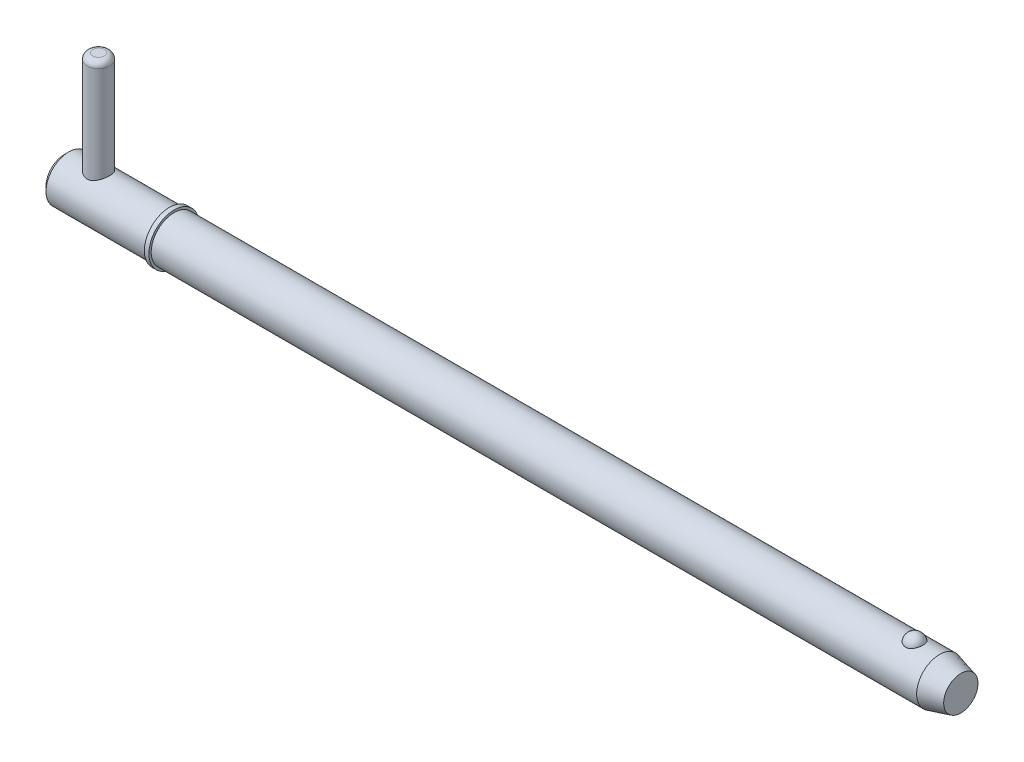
ISO-10303-21;
HEADER;
FILE_DESCRIPTION(('STEP AP214'),'2;1');
FILE_NAME('part.step','',(''),(''),'','','');
FILE_SCHEMA(('AUTOMOTIVE_DESIGN { 1 0 10303 214 1 1 1 1 }'));
ENDSEC;
DATA;
#1=APPLICATION_CONTEXT('core data for automotive mechanical design processes');
#2=APPLICATION_PROTOCOL_DEFINITION('international standard','automotive_design',2000,#1);
#3=PRODUCT_CONTEXT('',#1,'mechanical');
#4=PRODUCT('Part','Part','',(#3));
#5=PRODUCT_RELATED_PRODUCT_CATEGORY('part','',(#4));
#6=PRODUCT_DEFINITION_FORMATION('','',#4);
#7=PRODUCT_DEFINITION_CONTEXT('part definition',#1,'design');
#8=PRODUCT_DEFINITION('design','',#6,#7);
#9=PRODUCT_DEFINITION_SHAPE('','',#8);
#10=(LENGTH_UNIT() NAMED_UNIT(*) SI_UNIT(.MILLI.,.METRE.));
#11=(NAMED_UNIT(*) PLANE_ANGLE_UNIT() SI_UNIT($,.RADIAN.));
#12=(NAMED_UNIT(*) SI_UNIT($,.STERADIAN.) SOLID_ANGLE_UNIT());
#13=UNCERTAINTY_MEASURE_WITH_UNIT(LENGTH_MEASURE(1.E-05),#10,'distance_accuracy_value','');
#14=(GEOMETRIC_REPRESENTATION_CONTEXT(3) GLOBAL_UNCERTAINTY_ASSIGNED_CONTEXT((#13)) GLOBAL_UNIT_ASSIGNED_CONTEXT((#10,
#11,#12)) REPRESENTATION_CONTEXT('',''));
#15=CARTESIAN_POINT('',(0.,0.,0.));
#16=DIRECTION('',(0.,0.,1.));
#17=DIRECTION('',(1.,0.,0.));
#18=AXIS2_PLACEMENT_3D('',#15,#16,#17);
#19=CARTESIAN_POINT('',(5.94,21.43,0.));
#20=DIRECTION('',(0.,-1.,0.));
#21=DIRECTION('',(0.,0.,-1.));
#22=AXIS2_PLACEMENT_3D('',#19,#20,#21);
#23=CYLINDRICAL_SURFACE('',#22,1.98);
#24=CARTESIAN_POINT('',(5.94,-2.98,0.));
#25=DIRECTION('',(0.,1.,0.));
#26=DIRECTION('',(0.,0.,1.));
#27=AXIS2_PLACEMENT_3D('',#24,#25,#26);
#28=CIRCLE('',#27,1.98);
#29=CARTESIAN_POINT('',(5.94,-2.98,1.98));
#30=VERTEX_POINT('',#29);
#31=EDGE_CURVE('P0_E25',#30,#30,#28,.T.);
#32=ORIENTED_EDGE('',*,*,#31,.T.);
#33=EDGE_LOOP('',(#32));
#34=FACE_BOUND('',#33,.T.);
#35=CARTESIAN_POINT('',(5.94,20.44,0.));
#36=DIRECTION('',(0.,1.,0.));
#37=DIRECTION('',(0.,0.,1.));
#38=AXIS2_PLACEMENT_3D('',#35,#36,#37);
#39=CIRCLE('',#38,1.98);
#40=CARTESIAN_POINT('',(5.94,20.44,1.98));
#41=VERTEX_POINT('',#40);
#42=EDGE_CURVE('P0_E29',#41,#41,#39,.F.);
#43=ORIENTED_EDGE('',*,*,#42,.T.);
#44=EDGE_LOOP('',(#43));
#45=FACE_BOUND('',#44,.T.);
#46=ADVANCED_FACE('P0_F14',(#34,#45),#23,.T.);
#47=CARTESIAN_POINT('',(5.94,21.43,0.));
#48=DIRECTION('',(0.,1.,0.));
#49=DIRECTION('',(0.,0.,1.));
#50=AXIS2_PLACEMENT_3D('',#47,#48,#49);
#51=PLANE('',#50);
#52=CARTESIAN_POINT('',(5.94,21.43,0.));
#53=DIRECTION('',(0.,1.,0.));
#54=DIRECTION('',(0.,0.,1.));
#55=AXIS2_PLACEMENT_3D('',#52,#53,#54);
#56=CIRCLE('',#55,0.99);
#57=CARTESIAN_POINT('',(5.94,21.43,0.99));
#58=VERTEX_POINT('',#57);
#59=EDGE_CURVE('P0_E10',#58,#58,#56,.T.);
#60=ORIENTED_EDGE('',*,*,#59,.T.);
#61=EDGE_LOOP('',(#60));
#62=FACE_BOUND('',#61,.T.);
#63=ADVANCED_FACE('P0_F46',(#62),#51,.T.);
#64=CARTESIAN_POINT('',(5.94,-3.97,0.));
#65=DIRECTION('',(0.,1.,0.));
#66=DIRECTION('',(0.,0.,1.));
#67=AXIS2_PLACEMENT_3D('',#64,#65,#66);
#68=PLANE('',#67);
#69=CARTESIAN_POINT('',(5.94,-3.97,0.));
#70=DIRECTION('',(0.,1.,0.));
#71=DIRECTION('',(0.,0.,1.));
#72=AXIS2_PLACEMENT_3D('',#69,#70,#71);
#73=CIRCLE('',#72,0.99);
#74=CARTESIAN_POINT('',(5.94,-3.97,0.99));
#75=VERTEX_POINT('',#74);
#76=EDGE_CURVE('P0_E21',#75,#75,#73,.F.);
#77=ORIENTED_EDGE('',*,*,#76,.T.);
#78=EDGE_LOOP('',(#77));
#79=FACE_BOUND('',#78,.T.);
#80=ADVANCED_FACE('P0_F43',(#79),#68,.F.);
#81=CARTESIAN_POINT('',(5.94,-2.98,0.));
#82=DIRECTION('',(0.,1.,0.));
#83=DIRECTION('',(0.,0.,1.));
#84=AXIS2_PLACEMENT_3D('',#81,#82,#83);
#85=DEGENERATE_TOROIDAL_SURFACE('',#84,0.99,0.99,.T.);
#86=ORIENTED_EDGE('',*,*,#76,.F.);
#87=EDGE_LOOP('',(#86));
#88=FACE_BOUND('',#87,.T.);
#89=ORIENTED_EDGE('',*,*,#31,.F.);
#90=EDGE_LOOP('',(#89));
#91=FACE_BOUND('',#90,.T.);
#92=ADVANCED_FACE('P0_F38',(#88,#91),#85,.T.);
#93=CARTESIAN_POINT('',(5.94,20.44,0.));
#94=DIRECTION('',(0.,1.,0.));
#95=DIRECTION('',(0.,0.,1.));
#96=AXIS2_PLACEMENT_3D('',#93,#94,#95);
#97=DEGENERATE_TOROIDAL_SURFACE('',#96,0.99,0.99,.T.);
#98=ORIENTED_EDGE('',*,*,#42,.F.);
#99=EDGE_LOOP('',(#98));
#100=FACE_BOUND('',#99,.T.);
#101=ORIENTED_EDGE('',*,*,#59,.F.);
#102=EDGE_LOOP('',(#101));
#103=FACE_BOUND('',#102,.T.);
#104=ADVANCED_FACE('P0_F16',(#100,#103),#97,.T.);
#105=CLOSED_SHELL('',(#46,#63,#80,#92,#104));
#106=MANIFOLD_SOLID_BREP('P0_B1',#105);
#107=CARTESIAN_POINT('',(0.,0.,0.));
#108=DIRECTION('',(1.,0.,0.));
#109=DIRECTION('',(0.,0.,-1.));
#110=AXIS2_PLACEMENT_3D('',#107,#108,#109);
#111=CYLINDRICAL_SURFACE('',#110,3.97);
#112=CARTESIAN_POINT('',(151.875939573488,0.,0.));
#113=DIRECTION('',(1.,0.,0.));
#114=DIRECTION('',(0.,0.,-1.));
#115=AXIS2_PLACEMENT_3D('',#112,#113,#114);
#116=CIRCLE('',#115,3.97);
#117=CARTESIAN_POINT('',(151.875939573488,0.,-3.97));
#118=VERTEX_POINT('',#117);
#119=EDGE_CURVE('P1_E81',#118,#118,#116,.T.);
#120=ORIENTED_EDGE('',*,*,#119,.F.);
#121=EDGE_LOOP('',(#120));
#122=FACE_BOUND('',#121,.T.);
#123=CARTESIAN_POINT('',(19.05,0.,0.));
#124=DIRECTION('',(1.,0.,0.));
#125=DIRECTION('',(0.,0.,-1.));
#126=AXIS2_PLACEMENT_3D('',#123,#124,#125);
#127=CIRCLE('',#126,3.97);
#128=CARTESIAN_POINT('',(19.05,0.,-3.97));
#129=VERTEX_POINT('',#128);
#130=EDGE_CURVE('P1_E85',#129,#129,#127,.T.);
#131=ORIENTED_EDGE('',*,*,#130,.T.);
#132=EDGE_LOOP('',(#131));
#133=FACE_BOUND('',#132,.T.);
#134=CARTESIAN_POINT('',(147.545192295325,3.65715365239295,1.54470941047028));
#135=CARTESIAN_POINT('',(147.465244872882,3.65716001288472,1.54470290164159));
#136=CARTESIAN_POINT('',(147.385165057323,3.65987074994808,1.53832549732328));
#137=CARTESIAN_POINT('',(147.227237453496,3.67042218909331,1.51297018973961));
#138=CARTESIAN_POINT('',(147.14939614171,3.67827646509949,1.49395894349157));
#139=CARTESIAN_POINT('',(146.998461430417,3.69818848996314,1.44395950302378));
#140=CARTESIAN_POINT('',(146.925356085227,3.71023513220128,1.41300293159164));
#141=CARTESIAN_POINT('',(146.785563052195,3.73721833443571,1.34000212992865));
#142=CARTESIAN_POINT('',(146.718872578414,3.75215363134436,1.2979627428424));
#143=CARTESIAN_POINT('',(146.59148864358,3.78384968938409,1.20248834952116));
#144=CARTESIAN_POINT('',(146.531029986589,3.80065129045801,1.14875388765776));
#145=CARTESIAN_POINT('',(146.419694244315,3.83398532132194,1.03205417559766));
#146=CARTESIAN_POINT('',(146.368820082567,3.85051766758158,0.96908611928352));
#147=CARTESIAN_POINT('',(146.275632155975,3.88238608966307,0.832526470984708));
#148=CARTESIAN_POINT('',(146.233796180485,3.89763698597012,0.758588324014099));
#149=CARTESIAN_POINT('',(146.162510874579,3.92451063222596,0.604352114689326));
#150=CARTESIAN_POINT('',(146.133062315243,3.93613315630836,0.52405365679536));
#151=CARTESIAN_POINT('',(146.086892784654,3.95467606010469,0.358403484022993));
#152=CARTESIAN_POINT('',(146.070312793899,3.96154426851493,0.273006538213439));
#153=CARTESIAN_POINT('',(146.050756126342,3.96967008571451,0.100408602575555));
#154=CARTESIAN_POINT('',(146.047778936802,3.97092790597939,0.0132076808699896));
#155=CARTESIAN_POINT('',(146.055458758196,3.96771794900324,-0.159844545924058));
#156=CARTESIAN_POINT('',(146.066016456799,3.96329187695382,-0.245701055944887));
#157=CARTESIAN_POINT('',(146.10038009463,3.94923163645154,-0.414277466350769));
#158=CARTESIAN_POINT('',(146.124186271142,3.93959737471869,-0.496997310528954));
#159=CARTESIAN_POINT('',(146.18461142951,3.91607752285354,-0.65711357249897));
#160=CARTESIAN_POINT('',(146.221249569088,3.90218558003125,-0.734501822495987));
#161=CARTESIAN_POINT('',(146.306593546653,3.87158287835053,-0.881704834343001));
#162=CARTESIAN_POINT('',(146.355300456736,3.85487186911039,-0.951518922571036));
#163=CARTESIAN_POINT('',(146.464116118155,3.82028735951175,-1.08208159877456));
#164=CARTESIAN_POINT('',(146.524295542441,3.80240713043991,-1.14276958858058));
#165=CARTESIAN_POINT('',(146.654493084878,3.76758161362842,-1.25282437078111));
#166=CARTESIAN_POINT('',(146.724510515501,3.75063626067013,-1.30219195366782));
#167=CARTESIAN_POINT('',(146.87118160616,3.71998948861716,-1.38729709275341));
#168=CARTESIAN_POINT('',(146.947681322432,3.70623183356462,-1.42327904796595));
#169=CARTESIAN_POINT('',(147.106298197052,3.68323188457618,-1.48178996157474));
#170=CARTESIAN_POINT('',(147.1884132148,3.67398788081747,-1.50432401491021));
#171=CARTESIAN_POINT('',(147.351481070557,3.6615216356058,-1.53440939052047));
#172=CARTESIAN_POINT('',(147.432284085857,3.65801951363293,-1.54265826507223));
#173=CARTESIAN_POINT('',(147.59420850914,3.65657341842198,-1.54608423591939));
#174=CARTESIAN_POINT('',(147.675329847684,3.65862829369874,-1.54126404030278));
#175=CARTESIAN_POINT('',(147.832812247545,3.66788969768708,-1.51908474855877));
#176=CARTESIAN_POINT('',(147.909242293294,3.67492621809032,-1.50213925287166));
#177=CARTESIAN_POINT('',(148.058041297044,3.6931840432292,-1.45666982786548));
#178=CARTESIAN_POINT('',(148.130409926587,3.70440568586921,-1.42814496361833));
#179=CARTESIAN_POINT('',(148.270802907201,3.73012749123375,-1.3595631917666));
#180=CARTESIAN_POINT('',(148.338700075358,3.74469307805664,-1.31927107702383));
#181=CARTESIAN_POINT('',(148.466864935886,3.77545272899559,-1.22847440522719));
#182=CARTESIAN_POINT('',(148.527130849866,3.79164717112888,-1.17796747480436));
#183=CARTESIAN_POINT('',(148.641634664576,3.82490325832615,-1.06519260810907));
#184=CARTESIAN_POINT('',(148.695413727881,3.84196735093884,-1.00245914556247));
#185=CARTESIAN_POINT('',(148.792098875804,3.87439863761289,-0.868715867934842));
#186=CARTESIAN_POINT('',(148.835003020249,3.88976552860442,-0.797704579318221));
#187=CARTESIAN_POINT('',(148.910266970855,3.91771381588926,-0.646896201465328));
#188=CARTESIAN_POINT('',(148.94225322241,3.93019255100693,-0.566893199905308));
#189=CARTESIAN_POINT('',(148.993110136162,3.95043886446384,-0.402255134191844));
#190=CARTESIAN_POINT('',(149.011980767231,3.95820643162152,-0.317620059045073));
#191=CARTESIAN_POINT('',(149.03621625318,3.96823733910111,-0.14615699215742));
#192=CARTESIAN_POINT('',(149.041587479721,3.970503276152,-0.0593300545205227));
#193=CARTESIAN_POINT('',(149.038730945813,3.96930811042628,0.11405797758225));
#194=CARTESIAN_POINT('',(149.030503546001,3.9658471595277,0.200619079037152));
#195=CARTESIAN_POINT('',(149.000706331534,3.95358562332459,0.37050665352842));
#196=CARTESIAN_POINT('',(148.97921294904,3.94481563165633,0.453848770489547));
#197=CARTESIAN_POINT('',(148.92338397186,3.92284586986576,0.615497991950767));
#198=CARTESIAN_POINT('',(148.889047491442,3.90964579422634,0.693804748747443));
#199=CARTESIAN_POINT('',(148.807970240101,3.88006987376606,0.843703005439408));
#200=CARTESIAN_POINT('',(148.761153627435,3.86367478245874,0.915249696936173));
#201=CARTESIAN_POINT('',(148.656189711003,3.82949741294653,1.04910810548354));
#202=CARTESIAN_POINT('',(148.598042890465,3.81171519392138,1.11142021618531));
#203=CARTESIAN_POINT('',(148.471743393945,3.7767336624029,1.22503948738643));
#204=CARTESIAN_POINT('',(148.403597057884,3.75953398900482,1.27635357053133));
#205=CARTESIAN_POINT('',(148.258900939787,3.72770506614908,1.36653336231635));
#206=CARTESIAN_POINT('',(148.182348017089,3.7130767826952,1.4053943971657));
#207=CARTESIAN_POINT('',(148.025759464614,3.68864287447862,1.46830480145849));
#208=CARTESIAN_POINT('',(147.945930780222,3.67869017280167,1.49281289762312));
#209=CARTESIAN_POINT('',(147.782987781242,3.66414535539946,1.52817474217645));
#210=CARTESIAN_POINT('',(147.699884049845,3.65953723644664,1.53906926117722));
#211=CARTESIAN_POINT('',(147.592776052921,3.6573894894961,1.54414878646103));
#212=CARTESIAN_POINT('',(147.568990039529,3.65715175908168,1.54471134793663));
#213=CARTESIAN_POINT('',(147.545192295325,3.65715365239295,1.54470941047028));
#214=B_SPLINE_CURVE_WITH_KNOTS('',3,(#134,#135,#136,#137,#138,#139,#140,#141,#142,#143,#144,
#145,#146,#147,#148,#149,#150,#151,#152,#153,#154,#155,#156,#157,#158,#159,#160,#161,#162,#163,
#164,#165,#166,#167,#168,#169,#170,#171,#172,#173,#174,#175,#176,#177,#178,#179,#180,#181,#182,
#183,#184,#185,#186,#187,#188,#189,#190,#191,#192,#193,#194,#195,#196,#197,#198,#199,#200,#201,
#202,#203,#204,#205,#206,#207,#208,#209,#210,#211,#212,#213),.UNSPECIFIED.,.T.,.F.,(4,2,2,2,2,2,
2,2,2,2,2,2,2,2,2,2,2,2,2,2,2,2,2,2,2,2,2,2,2,2,2,2,2,2,2,2,2,2,2,4),(0.,0.239777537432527,
0.48019041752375,0.719971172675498,0.959647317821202,1.20639040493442,1.45320863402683,
1.71093679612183,1.96868099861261,2.22921052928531,2.48973023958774,2.74834928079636,
3.00697295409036,3.26598440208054,3.52501886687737,3.78570385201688,4.04637062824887,
4.30201257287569,4.55755760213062,4.80022994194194,5.04285200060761,5.27757006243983,
5.5123070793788,5.75210128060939,5.99195126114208,6.24392810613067,6.49594987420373,
6.75588818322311,7.01582710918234,7.2756433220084,7.53545264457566,7.79377886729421,
8.05212290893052,8.31207418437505,8.57201437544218,8.83179046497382,9.09166393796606,
9.34270057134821,9.59298357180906,9.66435753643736),.UNSPECIFIED.);
#215=CARTESIAN_POINT('',(147.545192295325,3.65715365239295,1.54470941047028));
#216=VERTEX_POINT('',#215);
#217=EDGE_CURVE('P1_E35',#216,#216,#214,.T.);
#218=ORIENTED_EDGE('',*,*,#217,.T.);
#219=EDGE_LOOP('',(#218));
#220=FACE_BOUND('',#219,.T.);
#221=ADVANCED_FACE('P1_F13',(#122,#133,#220),#111,.T.);
#222=CARTESIAN_POINT('',(0.,0.,0.));
#223=DIRECTION('',(-1.,0.,0.));
#224=DIRECTION('',(0.,0.,1.));
#225=AXIS2_PLACEMENT_3D('',#222,#223,#224);
#226=PLANE('',#225);
#227=CARTESIAN_POINT('',(0.,0.,0.));
#228=DIRECTION('',(1.,0.,0.));
#229=DIRECTION('',(0.,0.,-1.));
#230=AXIS2_PLACEMENT_3D('',#227,#228,#229);
#231=CIRCLE('',#230,3.176);
#232=CARTESIAN_POINT('',(0.,0.,-3.176));
#233=VERTEX_POINT('',#232);
#234=EDGE_CURVE('P1_E9',#233,#233,#231,.T.);
#235=ORIENTED_EDGE('',*,*,#234,.F.);
#236=EDGE_LOOP('',(#235));
#237=FACE_BOUND('',#236,.T.);
#238=ADVANCED_FACE('P1_F15',(#237),#226,.T.);
#239=CARTESIAN_POINT('',(0.793999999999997,0.,0.));
#240=DIRECTION('',(1.,0.,0.));
#241=DIRECTION('',(0.,0.,-1.));
#242=AXIS2_PLACEMENT_3D('',#239,#240,#241);
#243=CONICAL_SURFACE('',#242,3.97,0.78539816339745);
#244=ORIENTED_EDGE('',*,*,#234,.T.);
#245=EDGE_LOOP('',(#244));
#246=FACE_BOUND('',#245,.T.);
#247=CARTESIAN_POINT('',(0.793999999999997,0.,0.));
#248=DIRECTION('',(1.,0.,0.));
#249=DIRECTION('',(0.,0.,-1.));
#250=AXIS2_PLACEMENT_3D('',#247,#248,#249);
#251=CIRCLE('',#250,3.97);
#252=CARTESIAN_POINT('',(0.793999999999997,0.,-3.97));
#253=VERTEX_POINT('',#252);
#254=EDGE_CURVE('P1_E26',#253,#253,#251,.T.);
#255=ORIENTED_EDGE('',*,*,#254,.F.);
#256=EDGE_LOOP('',(#255));
#257=FACE_BOUND('',#256,.T.);
#258=ADVANCED_FACE('P1_F77',(#246,#257),#243,.T.);
#259=CARTESIAN_POINT('',(0.,0.,0.));
#260=DIRECTION('',(1.,0.,0.));
#261=DIRECTION('',(0.,0.,-1.));
#262=AXIS2_PLACEMENT_3D('',#259,#260,#261);
#263=CYLINDRICAL_SURFACE('',#262,3.97);
#264=CARTESIAN_POINT('',(5.94,-3.44100276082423,1.98));
#265=CARTESIAN_POINT('',(5.8367885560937,-3.44101282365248,1.97999171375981));
#266=CARTESIAN_POINT('',(5.73344176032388,-3.44571749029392,1.97187534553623));
#267=CARTESIAN_POINT('',(5.52991905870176,-3.46385873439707,1.93981946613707));
#268=CARTESIAN_POINT('',(5.42975031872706,-3.47731375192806,1.91584653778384));
#269=CARTESIAN_POINT('',(5.23590869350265,-3.51100678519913,1.85336773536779));
#270=CARTESIAN_POINT('',(5.14220446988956,-3.53120882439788,1.81493880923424));
#271=CARTESIAN_POINT('',(4.9625969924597,-3.57606420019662,1.72487335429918));
#272=CARTESIAN_POINT('',(4.87669412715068,-3.6007177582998,1.67323616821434));
#273=CARTESIAN_POINT('',(4.70734412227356,-3.65417020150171,1.55325205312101));
#274=CARTESIAN_POINT('',(4.62467662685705,-3.68314323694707,1.4838818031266));
#275=CARTESIAN_POINT('',(4.47154355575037,-3.74056406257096,1.33252902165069));
#276=CARTESIAN_POINT('',(4.40108404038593,-3.76901158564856,1.25054026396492));
#277=CARTESIAN_POINT('',(4.26974803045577,-3.82445556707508,1.06956584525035));
#278=CARTESIAN_POINT('',(4.20982960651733,-3.8512271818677,0.969809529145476));
#279=CARTESIAN_POINT('',(4.10798077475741,-3.89804342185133,0.760047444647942));
#280=CARTESIAN_POINT('',(4.06603907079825,-3.91809226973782,0.650048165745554));
#281=CARTESIAN_POINT('',(4.00441878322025,-3.94794912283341,0.431181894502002));
#282=CARTESIAN_POINT('',(3.98337329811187,-3.95838209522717,0.322786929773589));
#283=CARTESIAN_POINT('',(3.9596425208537,-3.97016407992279,0.103541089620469));
#284=CARTESIAN_POINT('',(3.95694618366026,-3.97151855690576,-0.00730826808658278));
#285=CARTESIAN_POINT('',(3.9694599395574,-3.96528826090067,-0.218044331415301));
#286=CARTESIAN_POINT('',(3.98314071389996,-3.95846689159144,-0.318049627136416));
#287=CARTESIAN_POINT('',(4.02528522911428,-3.93780347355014,-0.514124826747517));
#288=CARTESIAN_POINT('',(4.05375007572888,-3.92396089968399,-0.61019443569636));
#289=CARTESIAN_POINT('',(4.12484256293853,-3.89028355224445,-0.797351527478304));
#290=CARTESIAN_POINT('',(4.16766142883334,-3.87036821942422,-0.888351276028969));
#291=CARTESIAN_POINT('',(4.26598377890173,-3.82634285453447,-1.06209448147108));
#292=CARTESIAN_POINT('',(4.32149181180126,-3.8022313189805,-1.14483496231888));
#293=CARTESIAN_POINT('',(4.44962332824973,-3.74940011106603,-1.30802500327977));
#294=CARTESIAN_POINT('',(4.52336636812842,-3.72046031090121,-1.38752498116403));
#295=CARTESIAN_POINT('',(4.68287656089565,-3.66269463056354,-1.53354043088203));
#296=CARTESIAN_POINT('',(4.7686527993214,-3.63386885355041,-1.60004599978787));
#297=CARTESIAN_POINT('',(4.9564069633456,-3.57763161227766,-1.72228426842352));
#298=CARTESIAN_POINT('',(5.05906485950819,-3.5504233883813,-1.77707534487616));
#299=CARTESIAN_POINT('',(5.27381412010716,-3.50334038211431,-1.86819784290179));
#300=CARTESIAN_POINT('',(5.38589553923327,-3.48345798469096,-1.90454844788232));
#301=CARTESIAN_POINT('',(5.6069795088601,-3.45548331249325,-1.95481643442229));
#302=CARTESIAN_POINT('',(5.71552407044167,-3.44658268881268,-1.97028113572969));
#303=CARTESIAN_POINT('',(5.93399639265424,-3.43928114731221,-1.98300600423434));
#304=CARTESIAN_POINT('',(6.04392313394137,-3.44087289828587,-1.98027888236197));
#305=CARTESIAN_POINT('',(6.24931618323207,-3.45351901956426,-1.95811780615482));
#306=CARTESIAN_POINT('',(6.34505668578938,-3.46352725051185,-1.94052989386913));
#307=CARTESIAN_POINT('',(6.53204702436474,-3.49033612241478,-1.89188242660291));
#308=CARTESIAN_POINT('',(6.62329540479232,-3.50713894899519,-1.86081853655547));
#309=CARTESIAN_POINT('',(6.80352105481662,-3.54655680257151,-1.78458666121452));
#310=CARTESIAN_POINT('',(6.89219712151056,-3.56940508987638,-1.73883178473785));
#311=CARTESIAN_POINT('',(7.06112449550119,-3.61813012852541,-1.63502913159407));
#312=CARTESIAN_POINT('',(7.14137144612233,-3.6440084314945,-1.57697504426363));
#313=CARTESIAN_POINT('',(7.30168083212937,-3.69977514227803,-1.44171920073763));
#314=CARTESIAN_POINT('',(7.38046039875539,-3.7297597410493,-1.36302972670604));
#315=CARTESIAN_POINT('',(7.52409649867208,-3.78754991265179,-1.19307190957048));
#316=CARTESIAN_POINT('',(7.58894840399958,-3.81535475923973,-1.10179940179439));
#317=CARTESIAN_POINT('',(7.70430122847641,-3.86658972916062,-0.906019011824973));
#318=CARTESIAN_POINT('',(7.75438714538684,-3.88988795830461,-0.801229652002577));
#319=CARTESIAN_POINT('',(7.83572184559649,-3.92848199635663,-0.583216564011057));
#320=CARTESIAN_POINT('',(7.86698708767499,-3.94378479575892,-0.470000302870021));
#321=CARTESIAN_POINT('',(7.90711051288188,-3.96355307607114,-0.249525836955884));
#322=CARTESIAN_POINT('',(7.91775648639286,-3.96888171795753,-0.142669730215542));
#323=CARTESIAN_POINT('',(7.92160247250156,-3.97079858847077,0.0714191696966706));
#324=CARTESIAN_POINT('',(7.91480852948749,-3.96738984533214,0.178651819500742));
#325=CARTESIAN_POINT('',(7.88515479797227,-3.9527181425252,0.383072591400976));
#326=CARTESIAN_POINT('',(7.8633739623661,-3.94198303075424,0.480459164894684));
#327=CARTESIAN_POINT('',(7.80581513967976,-3.91422178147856,0.670038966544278));
#328=CARTESIAN_POINT('',(7.77003513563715,-3.89719473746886,0.762231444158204));
#329=CARTESIAN_POINT('',(7.68389191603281,-3.85747818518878,0.943248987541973));
#330=CARTESIAN_POINT('',(7.63296879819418,-3.83457704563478,1.03175978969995));
#331=CARTESIAN_POINT('',(7.51869140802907,-3.7855122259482,1.19934744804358));
#332=CARTESIAN_POINT('',(7.45533142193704,-3.75934704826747,1.2784199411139));
#333=CARTESIAN_POINT('',(7.31068939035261,-3.70329841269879,1.433144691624));
#334=CARTESIAN_POINT('',(7.22825362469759,-3.67330340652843,1.50768183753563));
#335=CARTESIAN_POINT('',(7.05162367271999,-3.61514025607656,1.64226879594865));
#336=CARTESIAN_POINT('',(6.95741928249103,-3.58697372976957,1.70230590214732));
#337=CARTESIAN_POINT('',(6.75590859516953,-3.53504049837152,1.80775364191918));
#338=CARTESIAN_POINT('',(6.64828786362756,-3.51143624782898,1.85265616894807));
#339=CARTESIAN_POINT('',(6.48137774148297,-3.48289659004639,1.90544537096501));
#340=CARTESIAN_POINT('',(6.42488151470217,-3.4745323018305,1.9206071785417));
#341=CARTESIAN_POINT('',(6.31046920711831,-3.4604244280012,1.94591259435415));
#342=CARTESIAN_POINT('',(6.25255415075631,-3.45467900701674,1.95605971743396));
#343=CARTESIAN_POINT('',(6.1521444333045,-3.44728060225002,1.96905939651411));
#344=CARTESIAN_POINT('',(6.10985721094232,-3.44493297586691,1.97315742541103));
#345=CARTESIAN_POINT('',(6.02505433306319,-3.44179192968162,1.97862952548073));
#346=CARTESIAN_POINT('',(5.98253866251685,-3.44099861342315,1.98000341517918));
#347=CARTESIAN_POINT('',(5.94,-3.44100276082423,1.98));
#348=B_SPLINE_CURVE_WITH_KNOTS('',3,(#264,#265,#266,#267,#268,#269,#270,#271,#272,#273,#274,
#275,#276,#277,#278,#279,#280,#281,#282,#283,#284,#285,#286,#287,#288,#289,#290,#291,#292,#293,
#294,#295,#296,#297,#298,#299,#300,#301,#302,#303,#304,#305,#306,#307,#308,#309,#310,#311,#312,
#313,#314,#315,#316,#317,#318,#319,#320,#321,#322,#323,#324,#325,#326,#327,#328,#329,#330,#331,
#332,#333,#334,#335,#336,#337,#338,#339,#340,#341,#342,#343,#344,#345,#346,#347),.UNSPECIFIED.,
.T.,.F.,(4,2,2,2,2,2,2,2,2,2,2,2,2,2,2,2,2,2,2,2,2,2,2,2,2,2,2,2,2,2,2,2,2,2,2,2,2,2,2,2,2,4),
(0.,0.309462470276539,0.619579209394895,0.928068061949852,1.23657226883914,1.57038619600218,
1.90436536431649,2.26071614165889,2.61684266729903,2.94773555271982,3.27842924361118,
3.58050679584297,3.88260694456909,4.18890317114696,4.49530936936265,4.83057163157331,
5.1660884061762,5.52272472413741,5.87898927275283,6.20706708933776,6.53491569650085,
6.82716910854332,7.11951660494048,7.42541184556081,7.73146442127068,8.07586334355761,
8.42037652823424,8.77380887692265,9.12693169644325,9.44775848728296,9.76847409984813,
10.0682302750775,10.3680296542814,10.6806938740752,10.9935020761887,11.3373031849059,
11.6814044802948,12.0361164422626,12.2131519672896,12.3900632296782,12.5175998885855,
12.6451450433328),.UNSPECIFIED.);
#349=CARTESIAN_POINT('',(5.94,-3.44100276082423,1.98));
#350=VERTEX_POINT('',#349);
#351=EDGE_CURVE('P1_E17',#350,#350,#348,.T.);
#352=ORIENTED_EDGE('',*,*,#351,.F.);
#353=EDGE_LOOP('',(#352));
#354=FACE_BOUND('',#353,.T.);
#355=CARTESIAN_POINT('',(5.94,3.44100276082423,1.98));
#356=CARTESIAN_POINT('',(6.0432114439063,3.44101282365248,1.97999171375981));
#357=CARTESIAN_POINT('',(6.14655823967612,3.44571749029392,1.97187534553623));
#358=CARTESIAN_POINT('',(6.35008094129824,3.46385873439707,1.93981946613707));
#359=CARTESIAN_POINT('',(6.45024968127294,3.47731375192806,1.91584653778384));
#360=CARTESIAN_POINT('',(6.64409130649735,3.51100678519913,1.85336773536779));
#361=CARTESIAN_POINT('',(6.73779553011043,3.53120882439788,1.81493880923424));
#362=CARTESIAN_POINT('',(6.91740300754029,3.57606420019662,1.72487335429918));
#363=CARTESIAN_POINT('',(7.00330587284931,3.6007177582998,1.67323616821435));
#364=CARTESIAN_POINT('',(7.17265587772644,3.65417020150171,1.55325205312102));
#365=CARTESIAN_POINT('',(7.25532337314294,3.68314323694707,1.4838818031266));
#366=CARTESIAN_POINT('',(7.40845644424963,3.74056406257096,1.3325290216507));
#367=CARTESIAN_POINT('',(7.47891595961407,3.76901158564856,1.25054026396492));
#368=CARTESIAN_POINT('',(7.61025196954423,3.82445556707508,1.06956584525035));
#369=CARTESIAN_POINT('',(7.67017039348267,3.8512271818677,0.969809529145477));
#370=CARTESIAN_POINT('',(7.77201922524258,3.89804342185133,0.760047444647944));
#371=CARTESIAN_POINT('',(7.81396092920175,3.91809226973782,0.650048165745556));
#372=CARTESIAN_POINT('',(7.87558121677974,3.94794912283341,0.431181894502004));
#373=CARTESIAN_POINT('',(7.89662670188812,3.95838209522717,0.322786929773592));
#374=CARTESIAN_POINT('',(7.9203574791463,3.97016407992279,0.103541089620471));
#375=CARTESIAN_POINT('',(7.92305381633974,3.97151855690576,-0.00730826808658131));
#376=CARTESIAN_POINT('',(7.9105400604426,3.96528826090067,-0.2180443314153));
#377=CARTESIAN_POINT('',(7.89685928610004,3.95846689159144,-0.318049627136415));
#378=CARTESIAN_POINT('',(7.85471477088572,3.93780347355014,-0.514124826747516));
#379=CARTESIAN_POINT('',(7.82624992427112,3.92396089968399,-0.61019443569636));
#380=CARTESIAN_POINT('',(7.75515743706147,3.89028355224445,-0.797351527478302));
#381=CARTESIAN_POINT('',(7.71233857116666,3.87036821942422,-0.888351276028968));
#382=CARTESIAN_POINT('',(7.61401622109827,3.82634285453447,-1.06209448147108));
#383=CARTESIAN_POINT('',(7.55850818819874,3.8022313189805,-1.14483496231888));
#384=CARTESIAN_POINT('',(7.43037667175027,3.74940011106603,-1.30802500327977));
#385=CARTESIAN_POINT('',(7.35663363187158,3.72046031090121,-1.38752498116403));
#386=CARTESIAN_POINT('',(7.19712343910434,3.66269463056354,-1.53354043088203));
#387=CARTESIAN_POINT('',(7.1113472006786,3.63386885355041,-1.60004599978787));
#388=CARTESIAN_POINT('',(6.9235930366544,3.57763161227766,-1.72228426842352));
#389=CARTESIAN_POINT('',(6.82093514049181,3.5504233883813,-1.77707534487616));
#390=CARTESIAN_POINT('',(6.60618587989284,3.50334038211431,-1.86819784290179));
#391=CARTESIAN_POINT('',(6.49410446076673,3.48345798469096,-1.90454844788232));
#392=CARTESIAN_POINT('',(6.2730204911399,3.45548331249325,-1.95481643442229));
#393=CARTESIAN_POINT('',(6.16447592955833,3.44658268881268,-1.97028113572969));
#394=CARTESIAN_POINT('',(5.94600360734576,3.43928114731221,-1.98300600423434));
#395=CARTESIAN_POINT('',(5.83607686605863,3.44087289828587,-1.98027888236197));
#396=CARTESIAN_POINT('',(5.63068381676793,3.45351901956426,-1.95811780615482));
#397=CARTESIAN_POINT('',(5.53494331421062,3.46352725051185,-1.94052989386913));
#398=CARTESIAN_POINT('',(5.34795297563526,3.49033612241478,-1.89188242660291));
#399=CARTESIAN_POINT('',(5.25670459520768,3.50713894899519,-1.86081853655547));
#400=CARTESIAN_POINT('',(5.07647894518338,3.54655680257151,-1.78458666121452));
#401=CARTESIAN_POINT('',(4.98780287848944,3.56940508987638,-1.73883178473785));
#402=CARTESIAN_POINT('',(4.81887550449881,3.61813012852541,-1.63502913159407));
#403=CARTESIAN_POINT('',(4.73862855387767,3.6440084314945,-1.57697504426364));
#404=CARTESIAN_POINT('',(4.57831916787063,3.69977514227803,-1.44171920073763));
#405=CARTESIAN_POINT('',(4.49953960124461,3.7297597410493,-1.36302972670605));
#406=CARTESIAN_POINT('',(4.35590350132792,3.78754991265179,-1.19307190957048));
#407=CARTESIAN_POINT('',(4.29105159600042,3.81535475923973,-1.10179940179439));
#408=CARTESIAN_POINT('',(4.17569877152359,3.86658972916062,-0.906019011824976));
#409=CARTESIAN_POINT('',(4.12561285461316,3.88988795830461,-0.80122965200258));
#410=CARTESIAN_POINT('',(4.04427815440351,3.92848199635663,-0.58321656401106));
#411=CARTESIAN_POINT('',(4.01301291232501,3.94378479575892,-0.470000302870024));
#412=CARTESIAN_POINT('',(3.97288948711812,3.96355307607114,-0.249525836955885));
#413=CARTESIAN_POINT('',(3.96224351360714,3.96888171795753,-0.142669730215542));
#414=CARTESIAN_POINT('',(3.95839752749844,3.97079858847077,0.0714191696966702));
#415=CARTESIAN_POINT('',(3.96519147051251,3.96738984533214,0.178651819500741));
#416=CARTESIAN_POINT('',(3.99484520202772,3.9527181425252,0.383072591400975));
#417=CARTESIAN_POINT('',(4.01662603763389,3.94198303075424,0.480459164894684));
#418=CARTESIAN_POINT('',(4.07418486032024,3.91422178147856,0.670038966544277));
#419=CARTESIAN_POINT('',(4.10996486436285,3.89719473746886,0.762231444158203));
#420=CARTESIAN_POINT('',(4.19610808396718,3.85747818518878,0.943248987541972));
#421=CARTESIAN_POINT('',(4.24703120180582,3.83457704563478,1.03175978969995));
#422=CARTESIAN_POINT('',(4.36130859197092,3.7855122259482,1.19934744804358));
#423=CARTESIAN_POINT('',(4.42466857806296,3.75934704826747,1.2784199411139));
#424=CARTESIAN_POINT('',(4.56931060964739,3.70329841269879,1.433144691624));
#425=CARTESIAN_POINT('',(4.65174637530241,3.67330340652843,1.50768183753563));
#426=CARTESIAN_POINT('',(4.82837632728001,3.61514025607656,1.64226879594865));
#427=CARTESIAN_POINT('',(4.92258071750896,3.58697372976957,1.70230590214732));
#428=CARTESIAN_POINT('',(5.12409140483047,3.53504049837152,1.80775364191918));
#429=CARTESIAN_POINT('',(5.23171213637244,3.51143624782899,1.85265616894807));
#430=CARTESIAN_POINT('',(5.39862225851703,3.48289659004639,1.90544537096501));
#431=CARTESIAN_POINT('',(5.45511848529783,3.4745323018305,1.9206071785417));
#432=CARTESIAN_POINT('',(5.56953079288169,3.4604244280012,1.94591259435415));
#433=CARTESIAN_POINT('',(5.62744584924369,3.45467900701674,1.95605971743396));
#434=CARTESIAN_POINT('',(5.7278555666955,3.44728060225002,1.9690593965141));
#435=CARTESIAN_POINT('',(5.77014278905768,3.44493297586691,1.97315742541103));
#436=CARTESIAN_POINT('',(5.85494566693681,3.44179192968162,1.97862952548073));
#437=CARTESIAN_POINT('',(5.89746133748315,3.44099861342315,1.98000341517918));
#438=CARTESIAN_POINT('',(5.94,3.44100276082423,1.98));
#439=B_SPLINE_CURVE_WITH_KNOTS('',3,(#355,#356,#357,#358,#359,#360,#361,#362,#363,#364,#365,
#366,#367,#368,#369,#370,#371,#372,#373,#374,#375,#376,#377,#378,#379,#380,#381,#382,#383,#384,
#385,#386,#387,#388,#389,#390,#391,#392,#393,#394,#395,#396,#397,#398,#399,#400,#401,#402,#403,
#404,#405,#406,#407,#408,#409,#410,#411,#412,#413,#414,#415,#416,#417,#418,#419,#420,#421,#422,
#423,#424,#425,#426,#427,#428,#429,#430,#431,#432,#433,#434,#435,#436,#437,#438),.UNSPECIFIED.,
.T.,.F.,(4,2,2,2,2,2,2,2,2,2,2,2,2,2,2,2,2,2,2,2,2,2,2,2,2,2,2,2,2,2,2,2,2,2,2,2,2,2,2,2,2,4),
(0.,0.309462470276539,0.619579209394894,0.928068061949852,1.23657226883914,1.57038619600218,
1.90436536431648,2.26071614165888,2.61684266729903,2.94773555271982,3.27842924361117,
3.58050679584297,3.88260694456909,4.18890317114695,4.49530936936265,4.83057163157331,
5.1660884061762,5.5227247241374,5.87898927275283,6.20706708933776,6.53491569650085,
6.82716910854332,7.11951660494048,7.42541184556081,7.73146442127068,8.07586334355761,
8.42037652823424,8.77380887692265,9.12693169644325,9.44775848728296,9.76847409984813,
10.0682302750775,10.3680296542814,10.6806938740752,10.9935020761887,11.3373031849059,
11.6814044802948,12.0361164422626,12.2131519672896,12.3900632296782,12.5175998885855,
12.6451450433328),.UNSPECIFIED.);
#440=CARTESIAN_POINT('',(5.94,3.44100276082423,1.98));
#441=VERTEX_POINT('',#440);
#442=EDGE_CURVE('P1_E43',#441,#441,#439,.T.);
#443=ORIENTED_EDGE('',*,*,#442,.F.);
#444=EDGE_LOOP('',(#443));
#445=FACE_BOUND('',#444,.T.);
#446=ORIENTED_EDGE('',*,*,#254,.T.);
#447=EDGE_LOOP('',(#446));
#448=FACE_BOUND('',#447,.T.);
#449=CARTESIAN_POINT('',(18.256,0.,0.));
#450=DIRECTION('',(1.,0.,0.));
#451=DIRECTION('',(0.,0.,-1.));
#452=AXIS2_PLACEMENT_3D('',#449,#450,#451);
#453=CIRCLE('',#452,3.97);
#454=CARTESIAN_POINT('',(18.256,0.,-3.97));
#455=VERTEX_POINT('',#454);
#456=EDGE_CURVE('P1_E31',#455,#455,#453,.T.);
#457=ORIENTED_EDGE('',*,*,#456,.F.);
#458=EDGE_LOOP('',(#457));
#459=FACE_BOUND('',#458,.T.);
#460=ADVANCED_FACE('P1_F103',(#354,#445,#448,#459),#263,.T.);
#461=CARTESIAN_POINT('',(18.256,3.97,0.));
#462=DIRECTION('',(-1.,0.,0.));
#463=DIRECTION('',(0.,0.,1.));
#464=AXIS2_PLACEMENT_3D('',#461,#462,#463);
#465=PLANE('',#464);
#466=ORIENTED_EDGE('',*,*,#456,.T.);
#467=EDGE_LOOP('',(#466));
#468=FACE_BOUND('',#467,.T.);
#469=CARTESIAN_POINT('',(18.256,0.,0.));
#470=DIRECTION('',(1.,0.,0.));
#471=DIRECTION('',(0.,0.,-1.));
#472=AXIS2_PLACEMENT_3D('',#469,#470,#471);
#473=CIRCLE('',#472,4.367);
#474=CARTESIAN_POINT('',(18.256,0.,-4.367));
#475=VERTEX_POINT('',#474);
#476=EDGE_CURVE('P1_E91',#475,#475,#473,.T.);
#477=ORIENTED_EDGE('',*,*,#476,.F.);
#478=EDGE_LOOP('',(#477));
#479=FACE_BOUND('',#478,.T.);
#480=ADVANCED_FACE('P1_F100',(#468,#479),#465,.T.);
#481=CARTESIAN_POINT('',(0.,0.,0.));
#482=DIRECTION('',(1.,0.,0.));
#483=DIRECTION('',(0.,0.,-1.));
#484=AXIS2_PLACEMENT_3D('',#481,#482,#483);
#485=CYLINDRICAL_SURFACE('',#484,4.367);
#486=ORIENTED_EDGE('',*,*,#476,.T.);
#487=EDGE_LOOP('',(#486));
#488=FACE_BOUND('',#487,.T.);
#489=CARTESIAN_POINT('',(19.05,0.,0.));
#490=DIRECTION('',(1.,0.,0.));
#491=DIRECTION('',(0.,0.,-1.));
#492=AXIS2_PLACEMENT_3D('',#489,#490,#491);
#493=CIRCLE('',#492,4.367);
#494=CARTESIAN_POINT('',(19.05,0.,-4.367));
#495=VERTEX_POINT('',#494);
#496=EDGE_CURVE('P1_E88',#495,#495,#493,.T.);
#497=ORIENTED_EDGE('',*,*,#496,.F.);
#498=EDGE_LOOP('',(#497));
#499=FACE_BOUND('',#498,.T.);
#500=ADVANCED_FACE('P1_F68',(#488,#499),#485,.T.);
#501=CARTESIAN_POINT('',(19.05,4.367,0.));
#502=DIRECTION('',(1.,0.,0.));
#503=DIRECTION('',(0.,0.,-1.));
#504=AXIS2_PLACEMENT_3D('',#501,#502,#503);
#505=PLANE('',#504);
#506=ORIENTED_EDGE('',*,*,#496,.T.);
#507=EDGE_LOOP('',(#506));
#508=FACE_BOUND('',#507,.T.);
#509=ORIENTED_EDGE('',*,*,#130,.F.);
#510=EDGE_LOOP('',(#509));
#511=FACE_BOUND('',#510,.T.);
#512=ADVANCED_FACE('P1_F62',(#508,#511),#505,.T.);
#513=CARTESIAN_POINT('',(155.58,0.,0.));
#514=DIRECTION('',(-1.,0.,0.));
#515=DIRECTION('',(0.,0.,1.));
#516=AXIS2_PLACEMENT_3D('',#513,#514,#515);
#517=CONICAL_SURFACE('',#516,2.97750000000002,0.26179938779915);
#518=ORIENTED_EDGE('',*,*,#119,.T.);
#519=EDGE_LOOP('',(#518));
#520=FACE_BOUND('',#519,.T.);
#521=CARTESIAN_POINT('',(155.58,0.,0.));
#522=DIRECTION('',(1.,0.,0.));
#523=DIRECTION('',(0.,0.,-1.));
#524=AXIS2_PLACEMENT_3D('',#521,#522,#523);
#525=CIRCLE('',#524,2.97750000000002);
#526=CARTESIAN_POINT('',(155.58,0.,-2.97750000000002));
#527=VERTEX_POINT('',#526);
#528=EDGE_CURVE('P1_E42',#527,#527,#525,.T.);
#529=ORIENTED_EDGE('',*,*,#528,.F.);
#530=EDGE_LOOP('',(#529));
#531=FACE_BOUND('',#530,.T.);
#532=ADVANCED_FACE('P1_F59',(#520,#531),#517,.T.);
#533=CARTESIAN_POINT('',(155.58,2.97750000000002,0.));
#534=DIRECTION('',(1.,0.,0.));
#535=DIRECTION('',(0.,0.,-1.));
#536=AXIS2_PLACEMENT_3D('',#533,#534,#535);
#537=PLANE('',#536);
#538=ORIENTED_EDGE('',*,*,#528,.T.);
#539=EDGE_LOOP('',(#538));
#540=FACE_BOUND('',#539,.T.);
#541=ADVANCED_FACE('P1_F55',(#540),#537,.T.);
#542=CARTESIAN_POINT('',(147.545192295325,3.573,0.));
#543=DIRECTION('',(-1.,0.,0.));
#544=DIRECTION('',(0.,-1.,0.));
#545=AXIS2_PLACEMENT_3D('',#542,#543,#544);
#546=SPHERICAL_SURFACE('',#545,1.54699999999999);
#547=ORIENTED_EDGE('',*,*,#217,.F.);
#548=EDGE_LOOP('',(#547));
#549=FACE_BOUND('',#548,.T.);
#550=ADVANCED_FACE('P1_F50',(#549),#546,.T.);
#551=CARTESIAN_POINT('',(5.94,-4.367,0.));
#552=DIRECTION('',(0.,1.,0.));
#553=DIRECTION('',(0.,0.,1.));
#554=AXIS2_PLACEMENT_3D('',#551,#552,#553);
#555=CYLINDRICAL_SURFACE('',#554,1.98);
#556=ORIENTED_EDGE('',*,*,#351,.T.);
#557=EDGE_LOOP('',(#556));
#558=FACE_BOUND('',#557,.T.);
#559=ORIENTED_EDGE('',*,*,#442,.T.);
#560=EDGE_LOOP('',(#559));
#561=FACE_BOUND('',#560,.T.);
#562=ADVANCED_FACE('P1_F54',(#558,#561),#555,.F.);
#563=CLOSED_SHELL('',(#221,#238,#258,#460,#480,#500,#512,#532,#541,#550,#562));
#564=MANIFOLD_SOLID_BREP('P1_B1',#563);
#565=ADVANCED_BREP_SHAPE_REPRESENTATION('',(#18,#106,#564),#14);
#566=SHAPE_DEFINITION_REPRESENTATION(#9,#565);
ENDSEC;
END-ISO-10303-21;
